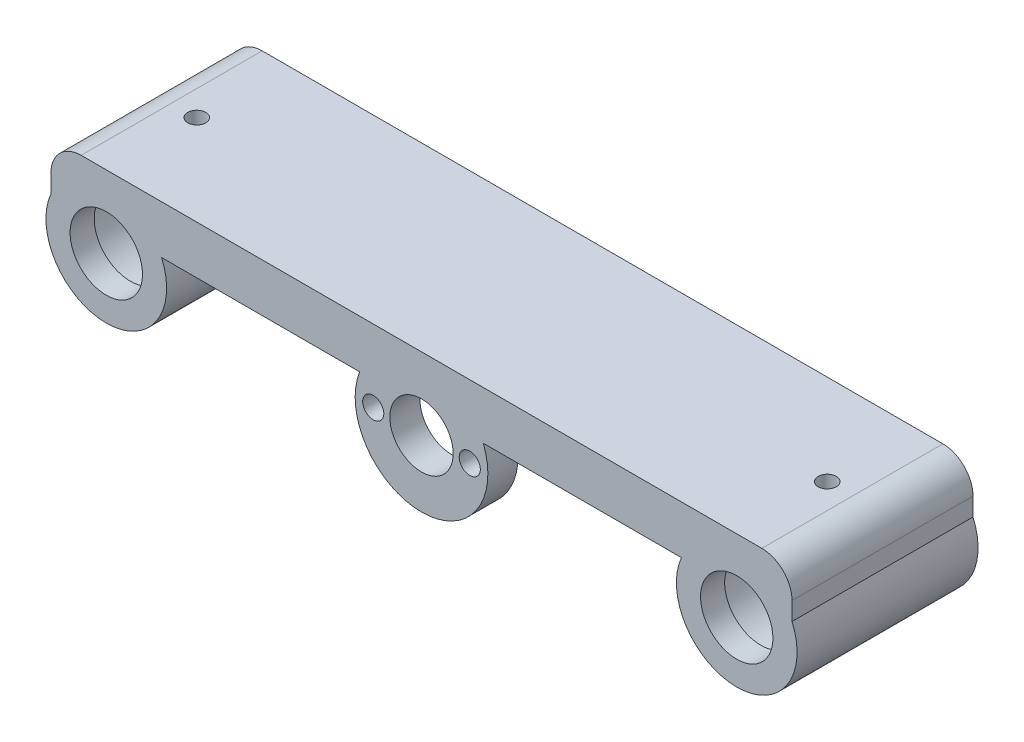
from build123d import *

# Parameters (mm, degrees)
SKETCH1_R           = 5.25
SKETCH1_R_2         = 7.75
SKETCH1_R_3         = 1.75
BOSS_EXTRUDE2_DEPTH = 30
FILLET5_R           = 5
BOSS_EXTRUDE3_START = -4
SKETCH2_R           = 7.75
SKETCH2_R_2         = 6
BOSS_EXTRUDE3_DEPTH = 4
CUT_EXTRUDE1_REACH  = 122.579
SKETCH3_R           = 1.5
CUT_EXTRUDE3_DEPTH  = 25


with BuildPart() as part:
    # Sketch1 → Boss-Extrude2 (new body)
    with BuildSketch(Plane.XY):
        with BuildLine():
            ThreePointArc((-9.16515139, 4), (0, -10), (9.16515139, 4))
            Line((9.16515139, 4), (42.003049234, 4))
            ThreePointArc((42.003049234, 4), (52.25, -11), (62.496950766, 4))
            Line((62.496950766, 4), (95.33484861, 4))
            ThreePointArc((95.33484861, 4), (104.5, -10), (113.66515139, 4))
            Line((113.66515139, 4), (113.66515139, 12))
            Line((113.66515139, 12), (-9.16515139, 12))
            Line((-9.16515139, 12), (-9.16515139, 4))
        make_face()
        with Locations((52.25, 0)):
            Circle(SKETCH1_R, mode=Mode.SUBTRACT)
        Circle(SKETCH1_R_2, mode=Mode.SUBTRACT)
        with Locations((60.25, 0)):
            Circle(SKETCH1_R_3, mode=Mode.SUBTRACT)
        with Locations((44.25, 0)):
            Circle(SKETCH1_R_3, mode=Mode.SUBTRACT)
        with Locations((104.5, 0)):
            Circle(SKETCH1_R_2, mode=Mode.SUBTRACT)
    extrude(amount=BOSS_EXTRUDE2_DEPTH)

    # Fillet5
    fillet5_edges = [part.edges().sort_by_distance(p)[0] for p in [
        (-9.16515139, 12, 15),
        (113.66515139, 12, 15),
    ]]
    fillet(fillet5_edges, radius=FILLET5_R)

    # Sketch2 → Boss-Extrude3 (add)
    # profile 1 of 2: a face of its own
    with BuildSketch(Plane.XY.offset(30).offset(BOSS_EXTRUDE3_START)):
        Circle(SKETCH2_R)
        Circle(SKETCH2_R_2, mode=Mode.SUBTRACT)
    # profile 2 of 2: a face of its own
    with BuildSketch(Plane.XY.offset(30).offset(BOSS_EXTRUDE3_START)):
        with Locations((104.5, 0)):
            Circle(SKETCH2_R)
        with Locations((104.5, 0)):
            Circle(SKETCH2_R_2, mode=Mode.SUBTRACT)
    extrude(amount=BOSS_EXTRUDE3_DEPTH)

    # Sketch3 → Cut-Extrude1 (cut, up to next)
    with BuildSketch(Plane(origin=(0, 12, 0), x_dir=(1, 0, 0), z_dir=(0, 1, 0)), mode=Mode.PRIVATE) as cut_extrude1_sk1:
        with Locations(Location((0, -15, 0), (0, 0, 270))):
            Circle(SKETCH3_R)
    cut_extrude1_tool1 = extrude(cut_extrude1_sk1.sketch, amount=-CUT_EXTRUDE1_REACH, mode=Mode.PRIVATE) & part.part
    # Sketch3 → Cut-Extrude1 (cut, up to next)
    with BuildSketch(Plane(origin=(0, 12, 0), x_dir=(1, 0, 0), z_dir=(0, 1, 0)), mode=Mode.PRIVATE) as cut_extrude1_sk2:
        with Locations(Location((104.5, -15, 0), (0, 0, 270))):
            Circle(SKETCH3_R)
    cut_extrude1_tool2 = extrude(cut_extrude1_sk2.sketch, amount=-CUT_EXTRUDE1_REACH, mode=Mode.PRIVATE) & part.part
    add(cut_extrude1_tool1.solids().sort_by_distance((0, 12, 15))[0], mode=Mode.SUBTRACT)
    add(cut_extrude1_tool2.solids().sort_by_distance((104.5, 12, 15))[0], mode=Mode.SUBTRACT)

    # Sketch5 → Cut-Extrude3 (cut)
    with BuildSketch(Plane(origin=(0, 0, 0), x_dir=(-1, 0, 0), z_dir=(0, 0, -1))):
        with BuildLine():
            Line((-62.496950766, 4), (-42.003049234, 4))
            ThreePointArc((-42.003049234, 4), (-52.25, -11), (-62.496950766, 4))
        make_face()
    extrude(amount=-CUT_EXTRUDE3_DEPTH, mode=Mode.SUBTRACT)


solid = part.part
